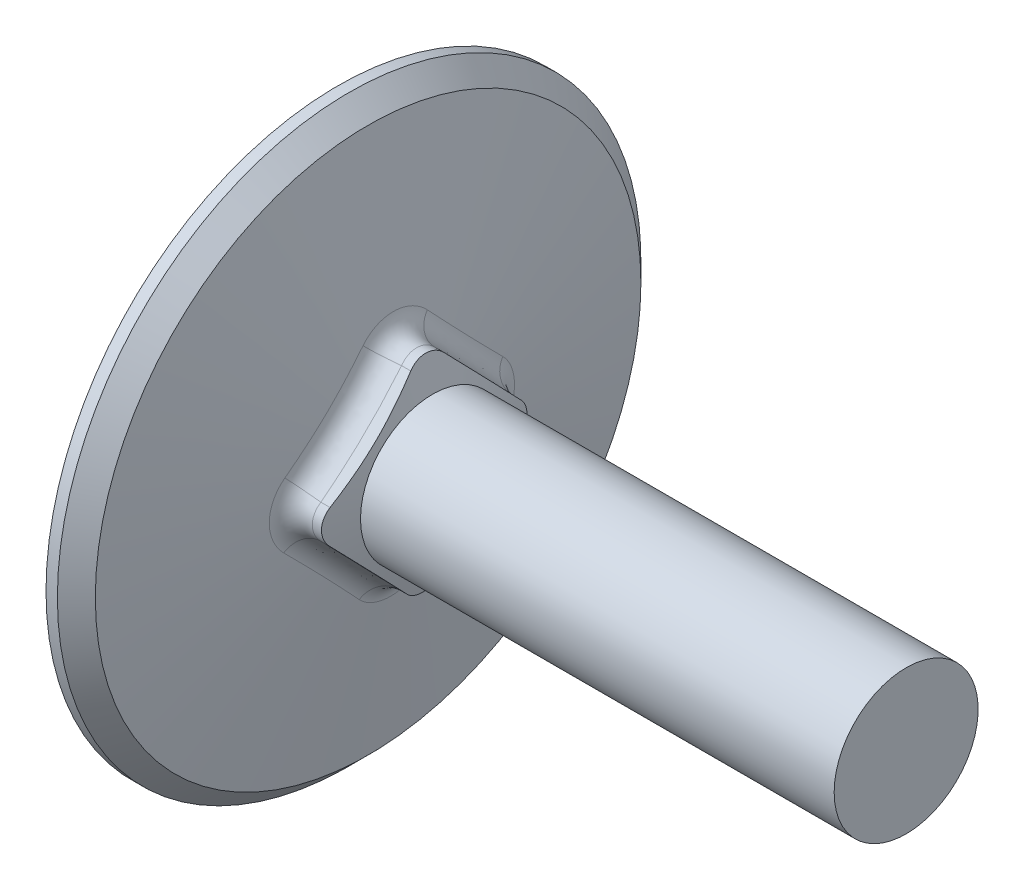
from build123d import *

# Parameters (mm, degrees)
NECK_DEPTH   = 3.175
HEADFILLET_R = 0.7874


with BuildPart() as part:
    # BodySke → BaseBody (revolve)
    with BuildSketch(Plane.XY, mode=Mode.PRIVATE) as basebody_sk:
        Polygon((0, 0), (0, 9.779), (0.381, 9.779), (1.016848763, 9.143151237), (2.0828, 2.413), (19.05, 2.413), (19.05, 0), align=None)
    revolve(basebody_sk.sketch.rotate(Axis((-6.35, 0, 0), (1, 0, 0)), 90), axis=Axis((-6.35, 0, 0), (1, 0, 0)))

    # Sketch2 → Neck (add)
    with BuildSketch(Plane(origin=(0, 0, 0), x_dir=(0, 0.6946583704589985, -0.7193398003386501), z_dir=(1, 0, 0))):
        with BuildLine():
            Line((1.8796, -2.667), (-1.8796, -2.667))
            ThreePointArc((-1.8796, -2.667), (-2.43637588, -2.43637588), (-2.667, -1.8796))
            Line((-2.667, -1.8796), (-2.667, 1.8796))
            ThreePointArc((-2.667, 1.8796), (-2.43637588, 2.43637588), (-1.8796, 2.667))
            Line((-1.8796, 2.667), (1.8796, 2.667))
            ThreePointArc((1.8796, 2.667), (2.43637588, 2.43637588), (2.667, 1.8796))
            Line((2.667, 1.8796), (2.667, -1.8796))
            ThreePointArc((2.667, -1.8796), (2.43637588, -2.43637588), (1.8796, -2.667))
        make_face()
    extrude(amount=NECK_DEPTH)

    # Sketch3 → NeckChamfer (revolve, cut)
    with BuildSketch(Plane.XY, mode=Mode.PRIVATE) as neckchamfer_sk:
        Polygon((-2.201668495, 22.479), (3.175, 2.413), (3.429, 2.413), (3.429, 22.479), align=None)
    revolve(neckchamfer_sk.sketch.rotate(Axis((0, 0, 0), (1, 0, 0)), 90), axis=Axis((0, 0, 0), (1, 0, 0)), mode=Mode.SUBTRACT)

    # HeadFillet
    headfillet_edges = [part.edges().sort_by_distance(p)[0] for p in [
        (2.042570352, 1.852653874, -1.918479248),
        (1.919259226, -0.06013324, -3.445031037),
        (2.042570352, -1.918479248, -1.852653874),
        (1.919259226, -3.445031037, 0.06013324),
        (2.042570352, -1.852653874, 1.918479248),
        (1.928141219, -0.270229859, 3.378687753),
        (2.042570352, 1.918479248, 1.852653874),
        (1.919259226, 3.445031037, -0.06013324),
    ]]
    fillet(headfillet_edges, radius=HEADFILLET_R)


solid = part.part
